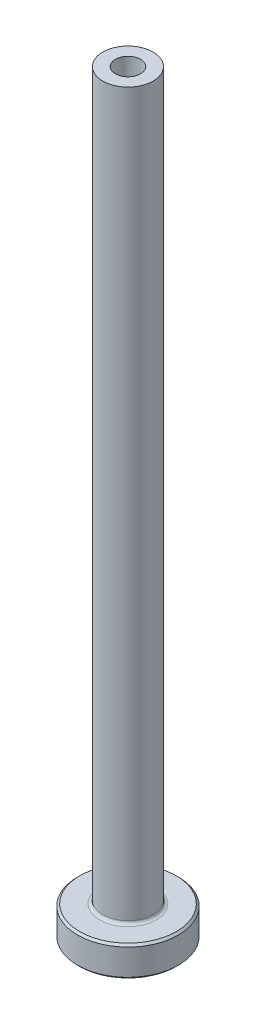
from build123d import *

# Parameters (mm, degrees)
FILLET1_R     = 0.3
CHAMFER1_SIZE = 0.2
CHAMFER3_SIZE = 0.5


with BuildPart() as part:
    # Sketch1 → Revolve1 (revolve)
    with BuildSketch(Plane.XY, mode=Mode.PRIVATE) as revolve1_sk:
        Polygon((-1.25, 75), (-2.5, 75), (-2.5, 3), (-5, 3), (-5, 0), (-1.5, 0), (-1.5, 28), (-1.25, 40), align=None)
    revolve(revolve1_sk.sketch.rotate(Axis((0, 92.187680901, 0), (0, -1, 0)), 270), axis=Axis((0, 92.187680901, 0), (0, -1, 0)))

    # Fillet1
    fillet1_edges = [part.edges().sort_by_distance(p)[0] for p in [
        (0, 3, -2.5),
    ]]
    fillet(fillet1_edges, radius=FILLET1_R)

    # Chamfer1
    chamfer1_edges = [part.edges().sort_by_distance(p)[0] for p in [
        (0, 0, -5),
        (0, 3, -5),
    ]]
    chamfer(chamfer1_edges, length=CHAMFER1_SIZE)

    # Chamfer3
    chamfer3_edges = [part.edges().sort_by_distance(p)[0] for p in [
        (0, 0, -1.5),
    ]]
    chamfer(chamfer3_edges, length=CHAMFER3_SIZE)


solid = part.part
